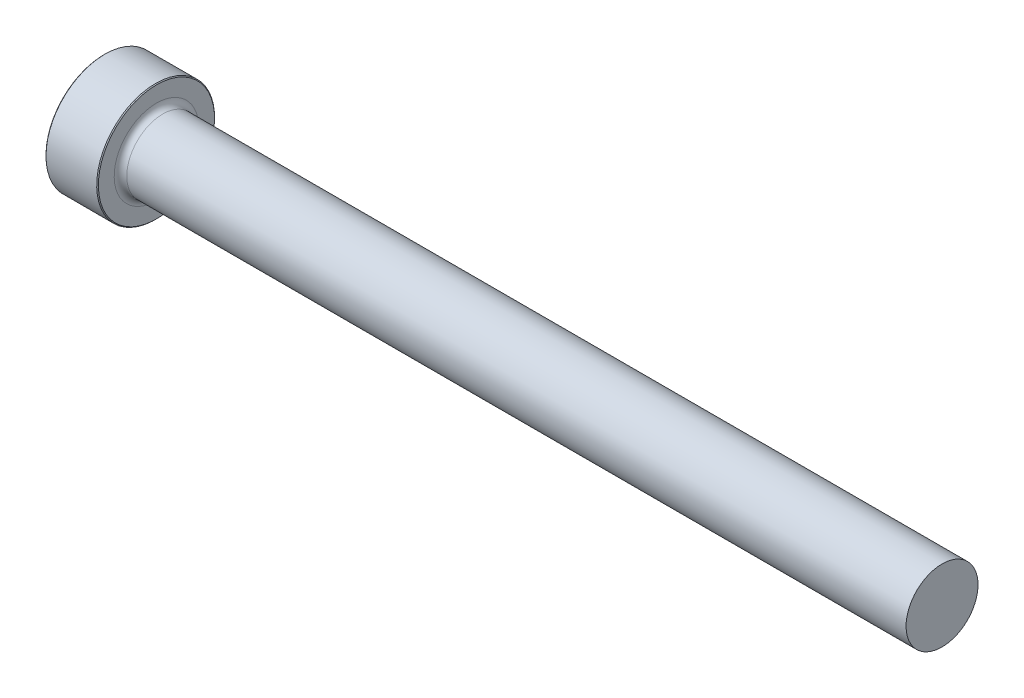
from build123d import *

# Parameters (mm, degrees)
CHAMFER1_SIZE = 0.1016


with BuildPart() as part:
    # Sketch1 → Revolve1 (revolve)
    with BuildSketch(Plane.XY):
        with BuildLine():
            Line((0, 0), (0, 7.14375))
            Line((0, 7.14375), (6.35, 7.14375))
            Line((6.35, 7.14375), (6.35, 5.123815))
            ThreePointArc((6.35, 5.123815), (6.573184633, 4.584999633), (7.112, 4.361815))
            Line((7.112, 4.361815), (101.6, 4.361815))
            Line((101.6, 4.361815), (101.6, 0))
            Line((101.6, 0), (0, 0))
        make_face()
    revolve(axis=Axis((101.6, 0, 0), (-1, 0, 0)))

    # Chamfer1
    chamfer1_edges = [part.edges().sort_by_distance(p)[0] for p in [
        (0, -7.14375, 0),
        (6.35, -7.14375, 0),
    ]]
    chamfer(chamfer1_edges, length=CHAMFER1_SIZE)


solid = part.part
